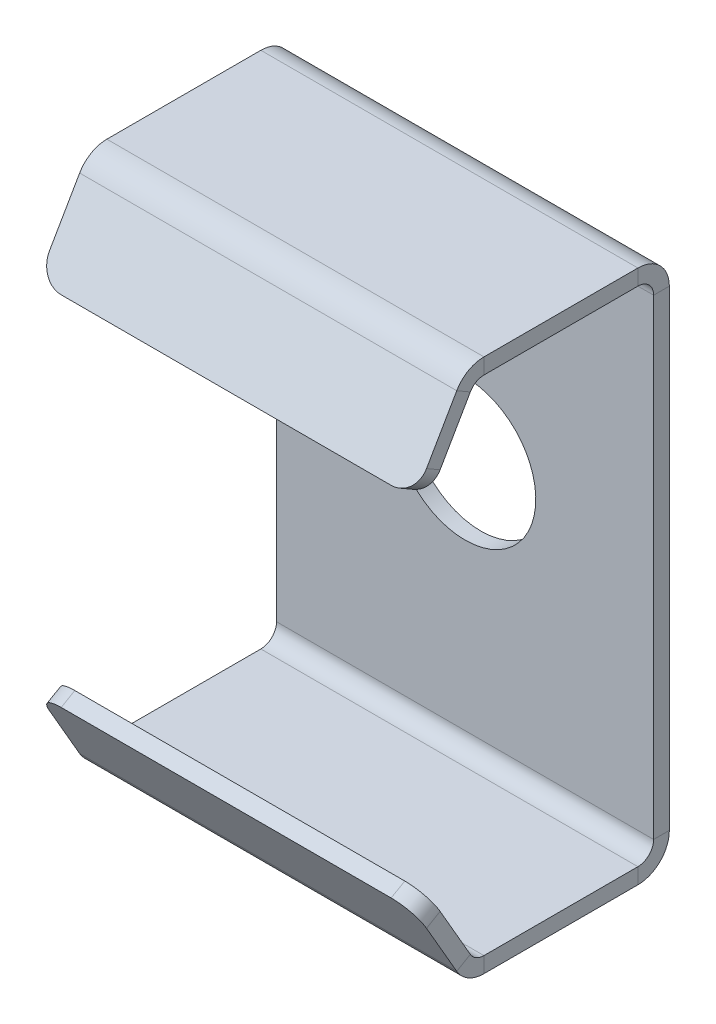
ISO-10303-21;
HEADER;
FILE_DESCRIPTION(('STEP AP214'),'2;1');
FILE_NAME('part.step','',(''),(''),'','','');
FILE_SCHEMA(('AUTOMOTIVE_DESIGN { 1 0 10303 214 1 1 1 1 }'));
ENDSEC;
DATA;
#1=APPLICATION_CONTEXT('core data for automotive mechanical design processes');
#2=APPLICATION_PROTOCOL_DEFINITION('international standard','automotive_design',2000,#1);
#3=PRODUCT_CONTEXT('',#1,'mechanical');
#4=PRODUCT('Part','Part','',(#3));
#5=PRODUCT_RELATED_PRODUCT_CATEGORY('part','',(#4));
#6=PRODUCT_DEFINITION_FORMATION('','',#4);
#7=PRODUCT_DEFINITION_CONTEXT('part definition',#1,'design');
#8=PRODUCT_DEFINITION('design','',#6,#7);
#9=PRODUCT_DEFINITION_SHAPE('','',#8);
#10=(LENGTH_UNIT() NAMED_UNIT(*) SI_UNIT(.MILLI.,.METRE.));
#11=(NAMED_UNIT(*) PLANE_ANGLE_UNIT() SI_UNIT($,.RADIAN.));
#12=(NAMED_UNIT(*) SI_UNIT($,.STERADIAN.) SOLID_ANGLE_UNIT());
#13=UNCERTAINTY_MEASURE_WITH_UNIT(LENGTH_MEASURE(1.E-05),#10,'distance_accuracy_value','');
#14=(GEOMETRIC_REPRESENTATION_CONTEXT(3) GLOBAL_UNCERTAINTY_ASSIGNED_CONTEXT((#13)) GLOBAL_UNIT_ASSIGNED_CONTEXT((#10,
#11,#12)) REPRESENTATION_CONTEXT('',''));
#15=CARTESIAN_POINT('',(0.,0.,0.));
#16=DIRECTION('',(0.,0.,1.));
#17=DIRECTION('',(1.,0.,0.));
#18=AXIS2_PLACEMENT_3D('',#15,#16,#17);
#19=CARTESIAN_POINT('',(10.5,-12.1698729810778,14.5886751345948));
#20=DIRECTION('',(0.,-0.5,0.866025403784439));
#21=DIRECTION('',(0.707106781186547,0.612372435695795,0.353553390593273));
#22=AXIS2_PLACEMENT_3D('',#19,#20,#21);
#23=CYLINDRICAL_SURFACE('',#22,1.5);
#24=CARTESIAN_POINT('',(10.5,-12.6698729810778,15.4547005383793));
#25=DIRECTION('',(0.,0.5,-0.866025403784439));
#26=DIRECTION('',(0.707106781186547,0.612372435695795,0.353553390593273));
#27=AXIS2_PLACEMENT_3D('',#24,#25,#26);
#28=CIRCLE('',#27,1.5);
#29=CARTESIAN_POINT('',(10.5,-11.3708348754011,16.2047005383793));
#30=VERTEX_POINT('',#29);
#31=CARTESIAN_POINT('',(12.,-12.6698729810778,15.4547005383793));
#32=VERTEX_POINT('',#31);
#33=EDGE_CURVE('E9',#30,#32,#28,.T.);
#34=ORIENTED_EDGE('',*,*,#33,.T.);
#35=DIRECTION('',(0.,0.5,-0.866025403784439));
#36=VECTOR('',#35,1.);
#37=CARTESIAN_POINT('',(12.,-12.1698729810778,14.5886751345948));
#38=LINE('',#37,#36);
#39=CARTESIAN_POINT('',(12.,-12.1698729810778,14.5886751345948));
#40=VERTEX_POINT('',#39);
#41=EDGE_CURVE('E25',#32,#40,#38,.T.);
#42=ORIENTED_EDGE('',*,*,#41,.T.);
#43=CARTESIAN_POINT('',(10.5,-12.1698729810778,14.5886751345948));
#44=DIRECTION('',(0.,-0.5,0.866025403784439));
#45=DIRECTION('',(0.707106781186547,0.612372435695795,0.353553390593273));
#46=AXIS2_PLACEMENT_3D('',#43,#44,#45);
#47=CIRCLE('',#46,1.5);
#48=CARTESIAN_POINT('',(10.5,-10.8708348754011,15.3386751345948));
#49=VERTEX_POINT('',#48);
#50=EDGE_CURVE('E438',#40,#49,#47,.T.);
#51=ORIENTED_EDGE('',*,*,#50,.T.);
#52=DIRECTION('',(0.,-0.5,0.866025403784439));
#53=VECTOR('',#52,1.);
#54=CARTESIAN_POINT('',(10.5,-10.8708348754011,15.3386751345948));
#55=LINE('',#54,#53);
#56=EDGE_CURVE('E433',#49,#30,#55,.T.);
#57=ORIENTED_EDGE('',*,*,#56,.T.);
#58=EDGE_LOOP('',(#34,#42,#51,#57));
#59=FACE_BOUND('',#58,.T.);
#60=ADVANCED_FACE('F14',(#59),#23,.T.);
#61=CARTESIAN_POINT('',(-12.,-10.8708348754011,15.3386751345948));
#62=DIRECTION('',(0.,0.866025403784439,0.5));
#63=DIRECTION('',(1.,0.,0.));
#64=AXIS2_PLACEMENT_3D('',#61,#62,#63);
#65=PLANE('',#64);
#66=ORIENTED_EDGE('',*,*,#56,.F.);
#67=DIRECTION('',(1.,0.,0.));
#68=VECTOR('',#67,1.);
#69=CARTESIAN_POINT('',(-12.,-10.8708348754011,15.3386751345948));
#70=LINE('',#69,#68);
#71=CARTESIAN_POINT('',(-10.5,-10.8708348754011,15.3386751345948));
#72=VERTEX_POINT('',#71);
#73=EDGE_CURVE('E468',#72,#49,#70,.T.);
#74=ORIENTED_EDGE('',*,*,#73,.F.);
#75=DIRECTION('',(0.,0.5,-0.866025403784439));
#76=VECTOR('',#75,1.);
#77=CARTESIAN_POINT('',(-10.5,-10.8708348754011,15.3386751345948));
#78=LINE('',#77,#76);
#79=CARTESIAN_POINT('',(-10.5,-11.3708348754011,16.2047005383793));
#80=VERTEX_POINT('',#79);
#81=EDGE_CURVE('E311',#80,#72,#78,.T.);
#82=ORIENTED_EDGE('',*,*,#81,.F.);
#83=DIRECTION('',(1.,0.,0.));
#84=VECTOR('',#83,1.);
#85=CARTESIAN_POINT('',(-12.,-11.3708348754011,16.2047005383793));
#86=LINE('',#85,#84);
#87=EDGE_CURVE('E429',#80,#30,#86,.T.);
#88=ORIENTED_EDGE('',*,*,#87,.T.);
#89=EDGE_LOOP('',(#66,#74,#82,#88));
#90=FACE_BOUND('',#89,.T.);
#91=ADVANCED_FACE('F657',(#90),#65,.T.);
#92=CARTESIAN_POINT('',(0.,-13.8383852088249,13.6253591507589));
#93=DIRECTION('',(0.,-0.5,0.866025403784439));
#94=DIRECTION('',(-1.,0.,0.));
#95=AXIS2_PLACEMENT_3D('',#92,#93,#94);
#96=PLANE('',#95);
#97=ORIENTED_EDGE('',*,*,#50,.F.);
#98=DIRECTION('',(0.,-0.866025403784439,-0.5));
#99=VECTOR('',#98,1.);
#100=CARTESIAN_POINT('',(12.,-19.4178066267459,10.4040786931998));
#101=LINE('',#100,#99);
#102=CARTESIAN_POINT('',(12.,-15.5,12.6660254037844));
#103=VERTEX_POINT('',#102);
#104=EDGE_CURVE('E434',#40,#103,#101,.T.);
#105=ORIENTED_EDGE('',*,*,#104,.T.);
#106=DIRECTION('',(-1.,0.,0.));
#107=VECTOR('',#106,1.);
#108=CARTESIAN_POINT('',(0.,-15.5,12.6660254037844));
#109=LINE('',#108,#107);
#110=CARTESIAN_POINT('',(-12.,-15.5,12.6660254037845));
#111=VERTEX_POINT('',#110);
#112=EDGE_CURVE('E472',#103,#111,#109,.T.);
#113=ORIENTED_EDGE('',*,*,#112,.T.);
#114=DIRECTION('',(0.,-0.866025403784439,-0.5));
#115=VECTOR('',#114,1.);
#116=CARTESIAN_POINT('',(-12.,-19.4178066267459,10.4040786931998));
#117=LINE('',#116,#115);
#118=CARTESIAN_POINT('',(-12.,-12.1698729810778,14.5886751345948));
#119=VERTEX_POINT('',#118);
#120=EDGE_CURVE('E328',#119,#111,#117,.T.);
#121=ORIENTED_EDGE('',*,*,#120,.F.);
#122=CARTESIAN_POINT('',(-10.5,-12.1698729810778,14.5886751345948));
#123=DIRECTION('',(0.,-0.5,0.866025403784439));
#124=DIRECTION('',(-0.707106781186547,0.612372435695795,0.353553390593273));
#125=AXIS2_PLACEMENT_3D('',#122,#123,#124);
#126=CIRCLE('',#125,1.5);
#127=EDGE_CURVE('E316',#72,#119,#126,.T.);
#128=ORIENTED_EDGE('',*,*,#127,.F.);
#129=ORIENTED_EDGE('',*,*,#73,.T.);
#130=EDGE_LOOP('',(#97,#105,#113,#121,#128,#129));
#131=FACE_BOUND('',#130,.T.);
#132=ADVANCED_FACE('F663',(#131),#96,.F.);
#133=CARTESIAN_POINT('',(-10.5,-12.1698729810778,14.5886751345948));
#134=DIRECTION('',(0.,-0.5,0.866025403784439));
#135=DIRECTION('',(-0.707106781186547,0.612372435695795,0.353553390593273));
#136=AXIS2_PLACEMENT_3D('',#133,#134,#135);
#137=CYLINDRICAL_SURFACE('',#136,1.5);
#138=CARTESIAN_POINT('',(-10.5,-12.6698729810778,15.4547005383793));
#139=DIRECTION('',(0.,0.5,-0.866025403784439));
#140=DIRECTION('',(-0.707106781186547,0.612372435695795,0.353553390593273));
#141=AXIS2_PLACEMENT_3D('',#138,#139,#140);
#142=CIRCLE('',#141,1.5);
#143=CARTESIAN_POINT('',(-12.,-12.6698729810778,15.4547005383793));
#144=VERTEX_POINT('',#143);
#145=EDGE_CURVE('E315',#144,#80,#142,.T.);
#146=ORIENTED_EDGE('',*,*,#145,.T.);
#147=ORIENTED_EDGE('',*,*,#81,.T.);
#148=ORIENTED_EDGE('',*,*,#127,.T.);
#149=DIRECTION('',(0.,-0.5,0.866025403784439));
#150=VECTOR('',#149,1.);
#151=CARTESIAN_POINT('',(-12.,-12.1698729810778,14.5886751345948));
#152=LINE('',#151,#150);
#153=EDGE_CURVE('E332',#119,#144,#152,.T.);
#154=ORIENTED_EDGE('',*,*,#153,.T.);
#155=EDGE_LOOP('',(#146,#147,#148,#154));
#156=FACE_BOUND('',#155,.T.);
#157=ADVANCED_FACE('F668',(#156),#137,.T.);
#158=CARTESIAN_POINT('',(-12.,-15.5,12.6660254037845));
#159=DIRECTION('',(-1.,0.,0.));
#160=DIRECTION('',(0.,1.,0.));
#161=AXIS2_PLACEMENT_3D('',#158,#159,#160);
#162=PLANE('',#161);
#163=ORIENTED_EDGE('',*,*,#153,.F.);
#164=ORIENTED_EDGE('',*,*,#120,.T.);
#165=DIRECTION('',(0.,-0.5,0.866025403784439));
#166=VECTOR('',#165,1.);
#167=CARTESIAN_POINT('',(-12.,-15.61,12.856550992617));
#168=LINE('',#167,#166);
#169=CARTESIAN_POINT('',(-12.,-16.,13.5320508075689));
#170=VERTEX_POINT('',#169);
#171=EDGE_CURVE('E333',#111,#170,#168,.T.);
#172=ORIENTED_EDGE('',*,*,#171,.T.);
#173=DIRECTION('',(0.,0.866025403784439,0.5));
#174=VECTOR('',#173,1.);
#175=CARTESIAN_POINT('',(-12.,-16.,13.5320508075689));
#176=LINE('',#175,#174);
#177=EDGE_CURVE('E368',#170,#144,#176,.T.);
#178=ORIENTED_EDGE('',*,*,#177,.T.);
#179=EDGE_LOOP('',(#163,#164,#172,#178));
#180=FACE_BOUND('',#179,.T.);
#181=ADVANCED_FACE('F680',(#180),#162,.T.);
#182=CARTESIAN_POINT('',(10.5,12.1698729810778,14.5886751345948));
#183=DIRECTION('',(0.,0.5,0.866025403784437));
#184=DIRECTION('',(0.707106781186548,-0.612372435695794,0.353553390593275));
#185=AXIS2_PLACEMENT_3D('',#182,#183,#184);
#186=CYLINDRICAL_SURFACE('',#185,1.5);
#187=CARTESIAN_POINT('',(10.5,12.6698729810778,15.4547005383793));
#188=DIRECTION('',(0.,-0.5,-0.866025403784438));
#189=DIRECTION('',(0.707106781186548,-0.612372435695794,0.353553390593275));
#190=AXIS2_PLACEMENT_3D('',#187,#188,#189);
#191=CIRCLE('',#190,1.5);
#192=CARTESIAN_POINT('',(12.,12.6698729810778,15.4547005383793));
#193=VERTEX_POINT('',#192);
#194=CARTESIAN_POINT('',(10.5,11.3708348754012,16.2047005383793));
#195=VERTEX_POINT('',#194);
#196=EDGE_CURVE('E357',#193,#195,#191,.T.);
#197=ORIENTED_EDGE('',*,*,#196,.T.);
#198=DIRECTION('',(0.,-0.5,-0.866025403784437));
#199=VECTOR('',#198,1.);
#200=CARTESIAN_POINT('',(10.5,10.8708348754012,15.3386751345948));
#201=LINE('',#200,#199);
#202=CARTESIAN_POINT('',(10.5,10.8708348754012,15.3386751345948));
#203=VERTEX_POINT('',#202);
#204=EDGE_CURVE('E353',#195,#203,#201,.T.);
#205=ORIENTED_EDGE('',*,*,#204,.T.);
#206=CARTESIAN_POINT('',(10.5,12.1698729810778,14.5886751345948));
#207=DIRECTION('',(0.,0.5,0.866025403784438));
#208=DIRECTION('',(0.707106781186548,-0.612372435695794,0.353553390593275));
#209=AXIS2_PLACEMENT_3D('',#206,#207,#208);
#210=CIRCLE('',#209,1.5);
#211=CARTESIAN_POINT('',(12.,12.1698729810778,14.5886751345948));
#212=VERTEX_POINT('',#211);
#213=EDGE_CURVE('E358',#203,#212,#210,.T.);
#214=ORIENTED_EDGE('',*,*,#213,.T.);
#215=DIRECTION('',(0.,0.5,0.866025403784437));
#216=VECTOR('',#215,1.);
#217=CARTESIAN_POINT('',(12.,12.1698729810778,14.5886751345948));
#218=LINE('',#217,#216);
#219=EDGE_CURVE('E387',#212,#193,#218,.T.);
#220=ORIENTED_EDGE('',*,*,#219,.T.);
#221=EDGE_LOOP('',(#197,#205,#214,#220));
#222=FACE_BOUND('',#221,.T.);
#223=ADVANCED_FACE('F629',(#222),#186,.T.);
#224=CARTESIAN_POINT('',(12.,15.5,12.6660254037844));
#225=DIRECTION('',(1.,0.,0.));
#226=DIRECTION('',(0.,-1.,0.));
#227=AXIS2_PLACEMENT_3D('',#224,#225,#226);
#228=PLANE('',#227);
#229=ORIENTED_EDGE('',*,*,#219,.F.);
#230=DIRECTION('',(0.,0.866025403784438,-0.5));
#231=VECTOR('',#230,1.);
#232=CARTESIAN_POINT('',(12.,19.4178066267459,10.4040786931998));
#233=LINE('',#232,#231);
#234=CARTESIAN_POINT('',(12.,15.5,12.6660254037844));
#235=VERTEX_POINT('',#234);
#236=EDGE_CURVE('E327',#212,#235,#233,.T.);
#237=ORIENTED_EDGE('',*,*,#236,.T.);
#238=DIRECTION('',(0.,0.5,0.866025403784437));
#239=VECTOR('',#238,1.);
#240=CARTESIAN_POINT('',(12.,15.61,12.856550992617));
#241=LINE('',#240,#239);
#242=CARTESIAN_POINT('',(12.,16.,13.5320508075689));
#243=VERTEX_POINT('',#242);
#244=EDGE_CURVE('E323',#235,#243,#241,.T.);
#245=ORIENTED_EDGE('',*,*,#244,.T.);
#246=DIRECTION('',(0.,-0.866025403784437,0.5));
#247=VECTOR('',#246,1.);
#248=CARTESIAN_POINT('',(12.,16.,13.5320508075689));
#249=LINE('',#248,#247);
#250=EDGE_CURVE('E321',#243,#193,#249,.T.);
#251=ORIENTED_EDGE('',*,*,#250,.T.);
#252=EDGE_LOOP('',(#229,#237,#245,#251));
#253=FACE_BOUND('',#252,.T.);
#254=ADVANCED_FACE('F625',(#253),#228,.T.);
#255=CARTESIAN_POINT('',(0.,13.8383852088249,13.6253591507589));
#256=DIRECTION('',(0.,-0.5,-0.866025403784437));
#257=DIRECTION('',(-1.,0.,0.));
#258=AXIS2_PLACEMENT_3D('',#255,#256,#257);
#259=PLANE('',#258);
#260=ORIENTED_EDGE('',*,*,#213,.F.);
#261=DIRECTION('',(-1.,0.,0.));
#262=VECTOR('',#261,1.);
#263=CARTESIAN_POINT('',(12.,10.8708348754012,15.3386751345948));
#264=LINE('',#263,#262);
#265=CARTESIAN_POINT('',(-10.5,10.8708348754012,15.3386751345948));
#266=VERTEX_POINT('',#265);
#267=EDGE_CURVE('E317',#203,#266,#264,.T.);
#268=ORIENTED_EDGE('',*,*,#267,.T.);
#269=CARTESIAN_POINT('',(-10.5,12.1698729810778,14.5886751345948));
#270=DIRECTION('',(0.,0.5,0.866025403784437));
#271=DIRECTION('',(-0.707106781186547,-0.612372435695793,0.353553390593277));
#272=AXIS2_PLACEMENT_3D('',#269,#270,#271);
#273=CIRCLE('',#272,1.5);
#274=CARTESIAN_POINT('',(-12.,12.1698729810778,14.5886751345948));
#275=VERTEX_POINT('',#274);
#276=EDGE_CURVE('E450',#275,#266,#273,.T.);
#277=ORIENTED_EDGE('',*,*,#276,.F.);
#278=DIRECTION('',(0.,0.866025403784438,-0.5));
#279=VECTOR('',#278,1.);
#280=CARTESIAN_POINT('',(-12.,19.4178066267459,10.4040786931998));
#281=LINE('',#280,#279);
#282=CARTESIAN_POINT('',(-12.,15.5,12.6660254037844));
#283=VERTEX_POINT('',#282);
#284=EDGE_CURVE('E322',#275,#283,#281,.T.);
#285=ORIENTED_EDGE('',*,*,#284,.T.);
#286=DIRECTION('',(1.,0.,0.));
#287=VECTOR('',#286,1.);
#288=CARTESIAN_POINT('',(0.,15.5,12.6660254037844));
#289=LINE('',#288,#287);
#290=EDGE_CURVE('E364',#283,#235,#289,.T.);
#291=ORIENTED_EDGE('',*,*,#290,.T.);
#292=ORIENTED_EDGE('',*,*,#236,.F.);
#293=EDGE_LOOP('',(#260,#268,#277,#285,#291,#292));
#294=FACE_BOUND('',#293,.T.);
#295=ADVANCED_FACE('F573',(#294),#259,.T.);
#296=CARTESIAN_POINT('',(-10.5,12.1698729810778,14.5886751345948));
#297=DIRECTION('',(0.,0.5,0.866025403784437));
#298=DIRECTION('',(-0.707106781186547,-0.612372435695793,0.353553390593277));
#299=AXIS2_PLACEMENT_3D('',#296,#297,#298);
#300=CYLINDRICAL_SURFACE('',#299,1.5);
#301=CARTESIAN_POINT('',(-10.5,12.6698729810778,15.4547005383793));
#302=DIRECTION('',(0.,-0.5,-0.866025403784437));
#303=DIRECTION('',(-0.707106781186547,-0.612372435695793,0.353553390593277));
#304=AXIS2_PLACEMENT_3D('',#301,#302,#303);
#305=CIRCLE('',#304,1.5);
#306=CARTESIAN_POINT('',(-10.5,11.3708348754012,16.2047005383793));
#307=VERTEX_POINT('',#306);
#308=CARTESIAN_POINT('',(-12.,12.6698729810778,15.4547005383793));
#309=VERTEX_POINT('',#308);
#310=EDGE_CURVE('E367',#307,#309,#305,.T.);
#311=ORIENTED_EDGE('',*,*,#310,.T.);
#312=DIRECTION('',(0.,-0.5,-0.866025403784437));
#313=VECTOR('',#312,1.);
#314=CARTESIAN_POINT('',(-12.,12.1698729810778,14.5886751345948));
#315=LINE('',#314,#313);
#316=EDGE_CURVE('E453',#309,#275,#315,.T.);
#317=ORIENTED_EDGE('',*,*,#316,.T.);
#318=ORIENTED_EDGE('',*,*,#276,.T.);
#319=DIRECTION('',(0.,0.5,0.866025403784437));
#320=VECTOR('',#319,1.);
#321=CARTESIAN_POINT('',(-10.5,10.8708348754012,15.3386751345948));
#322=LINE('',#321,#320);
#323=EDGE_CURVE('E280',#266,#307,#322,.T.);
#324=ORIENTED_EDGE('',*,*,#323,.T.);
#325=EDGE_LOOP('',(#311,#317,#318,#324));
#326=FACE_BOUND('',#325,.T.);
#327=ADVANCED_FACE('F636',(#326),#300,.T.);
#328=CARTESIAN_POINT('',(-12.,15.5,12.6660254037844));
#329=DIRECTION('',(-1.,0.,0.));
#330=DIRECTION('',(0.,0.,-1.));
#331=AXIS2_PLACEMENT_3D('',#328,#329,#330);
#332=PLANE('',#331);
#333=ORIENTED_EDGE('',*,*,#316,.F.);
#334=DIRECTION('',(0.,0.866025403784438,-0.5));
#335=VECTOR('',#334,1.);
#336=CARTESIAN_POINT('',(-12.,19.9178066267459,11.2701040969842));
#337=LINE('',#336,#335);
#338=CARTESIAN_POINT('',(-12.,16.,13.5320508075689));
#339=VERTEX_POINT('',#338);
#340=EDGE_CURVE('E276',#309,#339,#337,.T.);
#341=ORIENTED_EDGE('',*,*,#340,.T.);
#342=DIRECTION('',(0.,-0.5,-0.866025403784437));
#343=VECTOR('',#342,1.);
#344=CARTESIAN_POINT('',(-12.,15.61,12.856550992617));
#345=LINE('',#344,#343);
#346=EDGE_CURVE('E281',#339,#283,#345,.T.);
#347=ORIENTED_EDGE('',*,*,#346,.T.);
#348=ORIENTED_EDGE('',*,*,#284,.F.);
#349=EDGE_LOOP('',(#333,#341,#347,#348));
#350=FACE_BOUND('',#349,.T.);
#351=ADVANCED_FACE('F560',(#350),#332,.T.);
#352=CARTESIAN_POINT('',(0.,-15.,11.8));
#353=DIRECTION('',(-1.,0.,0.));
#354=DIRECTION('',(0.,-1.,0.));
#355=AXIS2_PLACEMENT_3D('',#352,#353,#354);
#356=CYLINDRICAL_SURFACE('',#355,2.);
#357=DIRECTION('',(1.,0.,0.));
#358=VECTOR('',#357,1.);
#359=CARTESIAN_POINT('',(0.,-16.,13.5320508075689));
#360=LINE('',#359,#358);
#361=CARTESIAN_POINT('',(12.,-16.,13.5320508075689));
#362=VERTEX_POINT('',#361);
#363=EDGE_CURVE('E334',#170,#362,#360,.T.);
#364=ORIENTED_EDGE('',*,*,#363,.F.);
#365=CARTESIAN_POINT('',(-12.,-15.,11.8));
#366=DIRECTION('',(-1.,0.,0.));
#367=DIRECTION('',(0.,-1.,0.));
#368=AXIS2_PLACEMENT_3D('',#365,#366,#367);
#369=CIRCLE('',#368,2.);
#370=CARTESIAN_POINT('',(-12.,-17.,11.8));
#371=VERTEX_POINT('',#370);
#372=EDGE_CURVE('E394',#371,#170,#369,.T.);
#373=ORIENTED_EDGE('',*,*,#372,.F.);
#374=DIRECTION('',(1.,0.,0.));
#375=VECTOR('',#374,1.);
#376=CARTESIAN_POINT('',(-12.,-17.,11.8));
#377=LINE('',#376,#375);
#378=CARTESIAN_POINT('',(12.,-17.,11.8));
#379=VERTEX_POINT('',#378);
#380=EDGE_CURVE('E491',#371,#379,#377,.T.);
#381=ORIENTED_EDGE('',*,*,#380,.T.);
#382=CARTESIAN_POINT('',(12.,-15.,11.8));
#383=DIRECTION('',(1.,0.,0.));
#384=DIRECTION('',(0.,-0.5,0.866025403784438));
#385=AXIS2_PLACEMENT_3D('',#382,#383,#384);
#386=CIRCLE('',#385,2.);
#387=EDGE_CURVE('E337',#362,#379,#386,.T.);
#388=ORIENTED_EDGE('',*,*,#387,.F.);
#389=EDGE_LOOP('',(#364,#373,#381,#388));
#390=FACE_BOUND('',#389,.T.);
#391=ADVANCED_FACE('F689',(#390),#356,.T.);
#392=CARTESIAN_POINT('',(12.,-15.5,12.6660254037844));
#393=DIRECTION('',(1.,0.,0.));
#394=DIRECTION('',(0.,-1.,0.));
#395=AXIS2_PLACEMENT_3D('',#392,#393,#394);
#396=PLANE('',#395);
#397=ORIENTED_EDGE('',*,*,#41,.F.);
#398=DIRECTION('',(0.,-0.866025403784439,-0.5));
#399=VECTOR('',#398,1.);
#400=CARTESIAN_POINT('',(12.,-19.9178066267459,11.2701040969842));
#401=LINE('',#400,#399);
#402=EDGE_CURVE('E495',#32,#362,#401,.T.);
#403=ORIENTED_EDGE('',*,*,#402,.T.);
#404=DIRECTION('',(0.,0.5,-0.866025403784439));
#405=VECTOR('',#404,1.);
#406=CARTESIAN_POINT('',(12.,-15.61,12.856550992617));
#407=LINE('',#406,#405);
#408=EDGE_CURVE('E343',#362,#103,#407,.T.);
#409=ORIENTED_EDGE('',*,*,#408,.T.);
#410=ORIENTED_EDGE('',*,*,#104,.F.);
#411=EDGE_LOOP('',(#397,#403,#409,#410));
#412=FACE_BOUND('',#411,.T.);
#413=ADVANCED_FACE('F723',(#412),#396,.T.);
#414=CARTESIAN_POINT('',(-12.,-15.5,12.6660254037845));
#415=DIRECTION('',(-1.,0.,0.));
#416=DIRECTION('',(0.,1.,0.));
#417=AXIS2_PLACEMENT_3D('',#414,#415,#416);
#418=PLANE('',#417);
#419=ORIENTED_EDGE('',*,*,#171,.F.);
#420=CARTESIAN_POINT('',(-12.,-15.,11.8));
#421=DIRECTION('',(1.,0.,0.));
#422=DIRECTION('',(0.,-0.5,0.866025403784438));
#423=AXIS2_PLACEMENT_3D('',#420,#421,#422);
#424=CIRCLE('',#423,1.);
#425=CARTESIAN_POINT('',(-12.,-16.,11.8));
#426=VERTEX_POINT('',#425);
#427=EDGE_CURVE('E339',#111,#426,#424,.T.);
#428=ORIENTED_EDGE('',*,*,#427,.T.);
#429=DIRECTION('',(0.,-1.,0.));
#430=VECTOR('',#429,1.);
#431=CARTESIAN_POINT('',(-12.,-16.,11.8));
#432=LINE('',#431,#430);
#433=EDGE_CURVE('E344',#426,#371,#432,.T.);
#434=ORIENTED_EDGE('',*,*,#433,.T.);
#435=ORIENTED_EDGE('',*,*,#372,.T.);
#436=EDGE_LOOP('',(#419,#428,#434,#435));
#437=FACE_BOUND('',#436,.T.);
#438=ADVANCED_FACE('F720',(#437),#418,.T.);
#439=CARTESIAN_POINT('',(12.,-16.,13.5320508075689));
#440=DIRECTION('',(1.,0.,0.));
#441=DIRECTION('',(0.,-1.,0.));
#442=AXIS2_PLACEMENT_3D('',#439,#440,#441);
#443=PLANE('',#442);
#444=ORIENTED_EDGE('',*,*,#408,.F.);
#445=ORIENTED_EDGE('',*,*,#387,.T.);
#446=DIRECTION('',(0.,-1.,0.));
#447=VECTOR('',#446,1.);
#448=CARTESIAN_POINT('',(12.,-16.,11.8));
#449=LINE('',#448,#447);
#450=CARTESIAN_POINT('',(12.,-16.,11.8));
#451=VERTEX_POINT('',#450);
#452=EDGE_CURVE('E247',#451,#379,#449,.T.);
#453=ORIENTED_EDGE('',*,*,#452,.F.);
#454=CARTESIAN_POINT('',(12.,-15.,11.8));
#455=DIRECTION('',(1.,0.,0.));
#456=DIRECTION('',(0.,-0.5,0.866025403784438));
#457=AXIS2_PLACEMENT_3D('',#454,#455,#456);
#458=CIRCLE('',#457,1.);
#459=EDGE_CURVE('E338',#103,#451,#458,.T.);
#460=ORIENTED_EDGE('',*,*,#459,.F.);
#461=EDGE_LOOP('',(#444,#445,#453,#460));
#462=FACE_BOUND('',#461,.T.);
#463=ADVANCED_FACE('F676',(#462),#443,.T.);
#464=CARTESIAN_POINT('',(0.,-14.3383852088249,14.4913845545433));
#465=DIRECTION('',(0.,-0.5,0.866025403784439));
#466=DIRECTION('',(-1.,0.,0.));
#467=AXIS2_PLACEMENT_3D('',#464,#465,#466);
#468=PLANE('',#467);
#469=ORIENTED_EDGE('',*,*,#33,.F.);
#470=ORIENTED_EDGE('',*,*,#87,.F.);
#471=ORIENTED_EDGE('',*,*,#145,.F.);
#472=ORIENTED_EDGE('',*,*,#177,.F.);
#473=ORIENTED_EDGE('',*,*,#363,.T.);
#474=ORIENTED_EDGE('',*,*,#402,.F.);
#475=EDGE_LOOP('',(#469,#470,#471,#472,#473,#474));
#476=FACE_BOUND('',#475,.T.);
#477=ADVANCED_FACE('F651',(#476),#468,.T.);
#478=CARTESIAN_POINT('',(0.,-15.,11.8));
#479=DIRECTION('',(-1.,0.,0.));
#480=DIRECTION('',(0.,-1.,0.));
#481=AXIS2_PLACEMENT_3D('',#478,#479,#480);
#482=CYLINDRICAL_SURFACE('',#481,1.);
#483=ORIENTED_EDGE('',*,*,#112,.F.);
#484=ORIENTED_EDGE('',*,*,#459,.T.);
#485=DIRECTION('',(1.,0.,0.));
#486=VECTOR('',#485,1.);
#487=CARTESIAN_POINT('',(-12.,-16.,11.8));
#488=LINE('',#487,#486);
#489=EDGE_CURVE('E262',#426,#451,#488,.T.);
#490=ORIENTED_EDGE('',*,*,#489,.F.);
#491=ORIENTED_EDGE('',*,*,#427,.F.);
#492=EDGE_LOOP('',(#483,#484,#490,#491));
#493=FACE_BOUND('',#492,.T.);
#494=ADVANCED_FACE('F643',(#493),#482,.F.);
#495=CARTESIAN_POINT('',(0.,15.,11.8));
#496=DIRECTION('',(1.,0.,0.));
#497=DIRECTION('',(0.,1.,0.));
#498=AXIS2_PLACEMENT_3D('',#495,#496,#497);
#499=CYLINDRICAL_SURFACE('',#498,2.);
#500=DIRECTION('',(-1.,0.,0.));
#501=VECTOR('',#500,1.);
#502=CARTESIAN_POINT('',(0.,16.,13.5320508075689));
#503=LINE('',#502,#501);
#504=EDGE_CURVE('E282',#243,#339,#503,.T.);
#505=ORIENTED_EDGE('',*,*,#504,.F.);
#506=CARTESIAN_POINT('',(12.,15.,11.8));
#507=DIRECTION('',(1.,0.,0.));
#508=DIRECTION('',(0.,1.,0.));
#509=AXIS2_PLACEMENT_3D('',#506,#507,#508);
#510=CIRCLE('',#509,2.);
#511=CARTESIAN_POINT('',(12.,17.,11.8));
#512=VERTEX_POINT('',#511);
#513=EDGE_CURVE('E473',#512,#243,#510,.T.);
#514=ORIENTED_EDGE('',*,*,#513,.F.);
#515=DIRECTION('',(-1.,0.,0.));
#516=VECTOR('',#515,1.);
#517=CARTESIAN_POINT('',(12.,17.,11.8));
#518=LINE('',#517,#516);
#519=CARTESIAN_POINT('',(-12.,17.,11.8));
#520=VERTEX_POINT('',#519);
#521=EDGE_CURVE('E301',#512,#520,#518,.T.);
#522=ORIENTED_EDGE('',*,*,#521,.T.);
#523=CARTESIAN_POINT('',(-12.,15.,11.8));
#524=DIRECTION('',(-1.,0.,0.));
#525=DIRECTION('',(0.,0.5,0.866025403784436));
#526=AXIS2_PLACEMENT_3D('',#523,#524,#525);
#527=CIRCLE('',#526,2.);
#528=EDGE_CURVE('E459',#339,#520,#527,.T.);
#529=ORIENTED_EDGE('',*,*,#528,.F.);
#530=EDGE_LOOP('',(#505,#514,#522,#529));
#531=FACE_BOUND('',#530,.T.);
#532=ADVANCED_FACE('F641',(#531),#499,.T.);
#533=CARTESIAN_POINT('',(12.,15.5,12.6660254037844));
#534=DIRECTION('',(1.,0.,0.));
#535=DIRECTION('',(0.,-1.,0.));
#536=AXIS2_PLACEMENT_3D('',#533,#534,#535);
#537=PLANE('',#536);
#538=ORIENTED_EDGE('',*,*,#244,.F.);
#539=CARTESIAN_POINT('',(12.,15.,11.8));
#540=DIRECTION('',(-1.,0.,0.));
#541=DIRECTION('',(0.,0.5,0.866025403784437));
#542=AXIS2_PLACEMENT_3D('',#539,#540,#541);
#543=CIRCLE('',#542,1.);
#544=CARTESIAN_POINT('',(12.,16.,11.8));
#545=VERTEX_POINT('',#544);
#546=EDGE_CURVE('E297',#235,#545,#543,.T.);
#547=ORIENTED_EDGE('',*,*,#546,.T.);
#548=DIRECTION('',(0.,1.,0.));
#549=VECTOR('',#548,1.);
#550=CARTESIAN_POINT('',(12.,16.,11.8));
#551=LINE('',#550,#549);
#552=EDGE_CURVE('E302',#545,#512,#551,.T.);
#553=ORIENTED_EDGE('',*,*,#552,.T.);
#554=ORIENTED_EDGE('',*,*,#513,.T.);
#555=EDGE_LOOP('',(#538,#547,#553,#554));
#556=FACE_BOUND('',#555,.T.);
#557=ADVANCED_FACE('F623',(#556),#537,.T.);
#558=CARTESIAN_POINT('',(-12.,16.,13.5320508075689));
#559=DIRECTION('',(-1.,0.,0.));
#560=DIRECTION('',(0.,0.,-1.));
#561=AXIS2_PLACEMENT_3D('',#558,#559,#560);
#562=PLANE('',#561);
#563=ORIENTED_EDGE('',*,*,#346,.F.);
#564=ORIENTED_EDGE('',*,*,#528,.T.);
#565=DIRECTION('',(0.,1.,0.));
#566=VECTOR('',#565,1.);
#567=CARTESIAN_POINT('',(-12.,16.,11.8));
#568=LINE('',#567,#566);
#569=CARTESIAN_POINT('',(-12.,16.,11.8));
#570=VERTEX_POINT('',#569);
#571=EDGE_CURVE('E395',#570,#520,#568,.T.);
#572=ORIENTED_EDGE('',*,*,#571,.F.);
#573=CARTESIAN_POINT('',(-12.,15.,11.8));
#574=DIRECTION('',(-1.,0.,0.));
#575=DIRECTION('',(0.,0.5,0.866025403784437));
#576=AXIS2_PLACEMENT_3D('',#573,#574,#575);
#577=CIRCLE('',#576,1.);
#578=EDGE_CURVE('E286',#283,#570,#577,.T.);
#579=ORIENTED_EDGE('',*,*,#578,.F.);
#580=EDGE_LOOP('',(#563,#564,#572,#579));
#581=FACE_BOUND('',#580,.T.);
#582=ADVANCED_FACE('F577',(#581),#562,.T.);
#583=CARTESIAN_POINT('',(12.,10.8708348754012,15.3386751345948));
#584=DIRECTION('',(0.,-0.866025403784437,0.5));
#585=DIRECTION('',(-1.,0.,0.));
#586=AXIS2_PLACEMENT_3D('',#583,#584,#585);
#587=PLANE('',#586);
#588=ORIENTED_EDGE('',*,*,#204,.F.);
#589=DIRECTION('',(-1.,0.,0.));
#590=VECTOR('',#589,1.);
#591=CARTESIAN_POINT('',(12.,11.3708348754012,16.2047005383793));
#592=LINE('',#591,#590);
#593=EDGE_CURVE('E285',#195,#307,#592,.T.);
#594=ORIENTED_EDGE('',*,*,#593,.T.);
#595=ORIENTED_EDGE('',*,*,#323,.F.);
#596=ORIENTED_EDGE('',*,*,#267,.F.);
#597=EDGE_LOOP('',(#588,#594,#595,#596));
#598=FACE_BOUND('',#597,.T.);
#599=ADVANCED_FACE('F633',(#598),#587,.T.);
#600=CARTESIAN_POINT('',(0.,14.3383852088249,14.4913845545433));
#601=DIRECTION('',(0.,-0.5,-0.866025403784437));
#602=DIRECTION('',(-1.,0.,0.));
#603=AXIS2_PLACEMENT_3D('',#600,#601,#602);
#604=PLANE('',#603);
#605=ORIENTED_EDGE('',*,*,#196,.F.);
#606=ORIENTED_EDGE('',*,*,#250,.F.);
#607=ORIENTED_EDGE('',*,*,#504,.T.);
#608=ORIENTED_EDGE('',*,*,#340,.F.);
#609=ORIENTED_EDGE('',*,*,#310,.F.);
#610=ORIENTED_EDGE('',*,*,#593,.F.);
#611=EDGE_LOOP('',(#605,#606,#607,#608,#609,#610));
#612=FACE_BOUND('',#611,.T.);
#613=ADVANCED_FACE('F638',(#612),#604,.F.);
#614=CARTESIAN_POINT('',(0.,15.,11.8));
#615=DIRECTION('',(1.,0.,0.));
#616=DIRECTION('',(0.,1.,0.));
#617=AXIS2_PLACEMENT_3D('',#614,#615,#616);
#618=CYLINDRICAL_SURFACE('',#617,1.);
#619=ORIENTED_EDGE('',*,*,#290,.F.);
#620=ORIENTED_EDGE('',*,*,#578,.T.);
#621=DIRECTION('',(-1.,0.,0.));
#622=VECTOR('',#621,1.);
#623=CARTESIAN_POINT('',(12.,16.,11.8));
#624=LINE('',#623,#622);
#625=EDGE_CURVE('E290',#545,#570,#624,.T.);
#626=ORIENTED_EDGE('',*,*,#625,.F.);
#627=ORIENTED_EDGE('',*,*,#546,.F.);
#628=EDGE_LOOP('',(#619,#620,#626,#627));
#629=FACE_BOUND('',#628,.T.);
#630=ADVANCED_FACE('F568',(#629),#618,.F.);
#631=CARTESIAN_POINT('',(0.,-15.,2.));
#632=DIRECTION('',(-1.,0.,0.));
#633=DIRECTION('',(0.,0.,-1.));
#634=AXIS2_PLACEMENT_3D('',#631,#632,#633);
#635=CYLINDRICAL_SURFACE('',#634,2.);
#636=DIRECTION('',(1.,0.,0.));
#637=VECTOR('',#636,1.);
#638=CARTESIAN_POINT('',(0.,-17.,2.));
#639=LINE('',#638,#637);
#640=CARTESIAN_POINT('',(-12.,-17.,2.));
#641=VERTEX_POINT('',#640);
#642=CARTESIAN_POINT('',(12.,-17.,2.));
#643=VERTEX_POINT('',#642);
#644=EDGE_CURVE('E211',#641,#643,#639,.T.);
#645=ORIENTED_EDGE('',*,*,#644,.F.);
#646=CARTESIAN_POINT('',(-12.,-15.,2.));
#647=DIRECTION('',(-1.,0.,0.));
#648=DIRECTION('',(0.,0.,-1.));
#649=AXIS2_PLACEMENT_3D('',#646,#647,#648);
#650=CIRCLE('',#649,2.);
#651=CARTESIAN_POINT('',(-12.,-15.,0.));
#652=VERTEX_POINT('',#651);
#653=EDGE_CURVE('E236',#652,#641,#650,.T.);
#654=ORIENTED_EDGE('',*,*,#653,.F.);
#655=DIRECTION('',(1.,0.,0.));
#656=VECTOR('',#655,1.);
#657=CARTESIAN_POINT('',(-12.,-15.,0.));
#658=LINE('',#657,#656);
#659=CARTESIAN_POINT('',(12.,-15.,0.));
#660=VERTEX_POINT('',#659);
#661=EDGE_CURVE('E231',#652,#660,#658,.T.);
#662=ORIENTED_EDGE('',*,*,#661,.T.);
#663=CARTESIAN_POINT('',(12.,-15.,2.));
#664=DIRECTION('',(1.,0.,0.));
#665=DIRECTION('',(0.,-1.,0.));
#666=AXIS2_PLACEMENT_3D('',#663,#664,#665);
#667=CIRCLE('',#666,2.);
#668=EDGE_CURVE('E227',#643,#660,#667,.T.);
#669=ORIENTED_EDGE('',*,*,#668,.F.);
#670=EDGE_LOOP('',(#645,#654,#662,#669));
#671=FACE_BOUND('',#670,.T.);
#672=ADVANCED_FACE('F229',(#671),#635,.T.);
#673=CARTESIAN_POINT('',(12.,-16.,2.));
#674=DIRECTION('',(1.,0.,0.));
#675=DIRECTION('',(0.,-1.,0.));
#676=AXIS2_PLACEMENT_3D('',#673,#674,#675);
#677=PLANE('',#676);
#678=DIRECTION('',(0.,1.,0.));
#679=VECTOR('',#678,1.);
#680=CARTESIAN_POINT('',(12.,-16.22,2.));
#681=LINE('',#680,#679);
#682=CARTESIAN_POINT('',(12.,-16.,2.));
#683=VERTEX_POINT('',#682);
#684=EDGE_CURVE('E241',#643,#683,#681,.T.);
#685=ORIENTED_EDGE('',*,*,#684,.T.);
#686=DIRECTION('',(0.,0.,-1.));
#687=VECTOR('',#686,1.);
#688=CARTESIAN_POINT('',(12.,-16.,-2.52389342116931));
#689=LINE('',#688,#687);
#690=EDGE_CURVE('E296',#451,#683,#689,.T.);
#691=ORIENTED_EDGE('',*,*,#690,.F.);
#692=ORIENTED_EDGE('',*,*,#452,.T.);
#693=DIRECTION('',(0.,0.,-1.));
#694=VECTOR('',#693,1.);
#695=CARTESIAN_POINT('',(12.,-17.,-2.52389342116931));
#696=LINE('',#695,#694);
#697=EDGE_CURVE('E216',#379,#643,#696,.T.);
#698=ORIENTED_EDGE('',*,*,#697,.T.);
#699=EDGE_LOOP('',(#685,#691,#692,#698));
#700=FACE_BOUND('',#699,.T.);
#701=ADVANCED_FACE('F249',(#700),#677,.T.);
#702=CARTESIAN_POINT('',(0.,-16.,5.76902664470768));
#703=DIRECTION('',(0.,1.,0.));
#704=DIRECTION('',(1.,0.,0.));
#705=AXIS2_PLACEMENT_3D('',#702,#703,#704);
#706=PLANE('',#705);
#707=DIRECTION('',(-1.,0.,0.));
#708=VECTOR('',#707,1.);
#709=CARTESIAN_POINT('',(0.,-16.,2.));
#710=LINE('',#709,#708);
#711=CARTESIAN_POINT('',(-12.,-16.,2.));
#712=VERTEX_POINT('',#711);
#713=EDGE_CURVE('E253',#683,#712,#710,.T.);
#714=ORIENTED_EDGE('',*,*,#713,.T.);
#715=DIRECTION('',(0.,0.,-1.));
#716=VECTOR('',#715,1.);
#717=CARTESIAN_POINT('',(-12.,-16.,-2.5238934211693));
#718=LINE('',#717,#716);
#719=EDGE_CURVE('E222',#426,#712,#718,.T.);
#720=ORIENTED_EDGE('',*,*,#719,.F.);
#721=ORIENTED_EDGE('',*,*,#489,.T.);
#722=ORIENTED_EDGE('',*,*,#690,.T.);
#723=EDGE_LOOP('',(#714,#720,#721,#722));
#724=FACE_BOUND('',#723,.T.);
#725=ADVANCED_FACE('F716',(#724),#706,.T.);
#726=CARTESIAN_POINT('',(-12.,-16.,2.));
#727=DIRECTION('',(-1.,0.,0.));
#728=DIRECTION('',(0.,0.,-1.));
#729=AXIS2_PLACEMENT_3D('',#726,#727,#728);
#730=PLANE('',#729);
#731=DIRECTION('',(0.,-1.,0.));
#732=VECTOR('',#731,1.);
#733=CARTESIAN_POINT('',(-12.,-16.22,2.));
#734=LINE('',#733,#732);
#735=EDGE_CURVE('E437',#712,#641,#734,.T.);
#736=ORIENTED_EDGE('',*,*,#735,.F.);
#737=CARTESIAN_POINT('',(-12.,-15.,2.));
#738=DIRECTION('',(1.,0.,0.));
#739=DIRECTION('',(0.,-1.,0.));
#740=AXIS2_PLACEMENT_3D('',#737,#738,#739);
#741=CIRCLE('',#740,1.);
#742=CARTESIAN_POINT('',(-12.,-15.,1.));
#743=VERTEX_POINT('',#742);
#744=EDGE_CURVE('E292',#712,#743,#741,.T.);
#745=ORIENTED_EDGE('',*,*,#744,.T.);
#746=DIRECTION('',(0.,0.,1.));
#747=VECTOR('',#746,1.);
#748=CARTESIAN_POINT('',(-12.,-15.,0.));
#749=LINE('',#748,#747);
#750=EDGE_CURVE('E424',#652,#743,#749,.T.);
#751=ORIENTED_EDGE('',*,*,#750,.F.);
#752=ORIENTED_EDGE('',*,*,#653,.T.);
#753=EDGE_LOOP('',(#736,#745,#751,#752));
#754=FACE_BOUND('',#753,.T.);
#755=ADVANCED_FACE('F695',(#754),#730,.T.);
#756=CARTESIAN_POINT('',(12.,-17.,2.));
#757=DIRECTION('',(1.,0.,0.));
#758=DIRECTION('',(0.,-1.,0.));
#759=AXIS2_PLACEMENT_3D('',#756,#757,#758);
#760=PLANE('',#759);
#761=ORIENTED_EDGE('',*,*,#684,.F.);
#762=ORIENTED_EDGE('',*,*,#668,.T.);
#763=DIRECTION('',(0.,0.,1.));
#764=VECTOR('',#763,1.);
#765=CARTESIAN_POINT('',(12.,-15.,0.));
#766=LINE('',#765,#764);
#767=CARTESIAN_POINT('',(12.,-15.,1.));
#768=VERTEX_POINT('',#767);
#769=EDGE_CURVE('E237',#660,#768,#766,.T.);
#770=ORIENTED_EDGE('',*,*,#769,.T.);
#771=CARTESIAN_POINT('',(12.,-15.,2.));
#772=DIRECTION('',(1.,0.,0.));
#773=DIRECTION('',(0.,-1.,0.));
#774=AXIS2_PLACEMENT_3D('',#771,#772,#773);
#775=CIRCLE('',#774,1.);
#776=EDGE_CURVE('E223',#683,#768,#775,.T.);
#777=ORIENTED_EDGE('',*,*,#776,.F.);
#778=EDGE_LOOP('',(#761,#762,#770,#777));
#779=FACE_BOUND('',#778,.T.);
#780=ADVANCED_FACE('F242',(#779),#760,.T.);
#781=CARTESIAN_POINT('',(-12.,-16.,2.));
#782=DIRECTION('',(-1.,0.,0.));
#783=DIRECTION('',(0.,0.,-1.));
#784=AXIS2_PLACEMENT_3D('',#781,#782,#783);
#785=PLANE('',#784);
#786=ORIENTED_EDGE('',*,*,#735,.T.);
#787=DIRECTION('',(0.,0.,1.));
#788=VECTOR('',#787,1.);
#789=CARTESIAN_POINT('',(-12.,-17.,2.));
#790=LINE('',#789,#788);
#791=EDGE_CURVE('E18',#641,#371,#790,.T.);
#792=ORIENTED_EDGE('',*,*,#791,.T.);
#793=ORIENTED_EDGE('',*,*,#433,.F.);
#794=ORIENTED_EDGE('',*,*,#719,.T.);
#795=EDGE_LOOP('',(#786,#792,#793,#794));
#796=FACE_BOUND('',#795,.T.);
#797=ADVANCED_FACE('F693',(#796),#785,.T.);
#798=CARTESIAN_POINT('',(0.,-17.,5.76902664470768));
#799=DIRECTION('',(0.,1.,0.));
#800=DIRECTION('',(1.,0.,0.));
#801=AXIS2_PLACEMENT_3D('',#798,#799,#800);
#802=PLANE('',#801);
#803=ORIENTED_EDGE('',*,*,#644,.T.);
#804=ORIENTED_EDGE('',*,*,#697,.F.);
#805=ORIENTED_EDGE('',*,*,#380,.F.);
#806=ORIENTED_EDGE('',*,*,#791,.F.);
#807=EDGE_LOOP('',(#803,#804,#805,#806));
#808=FACE_BOUND('',#807,.T.);
#809=ADVANCED_FACE('F213',(#808),#802,.F.);
#810=CARTESIAN_POINT('',(0.,-15.,2.));
#811=DIRECTION('',(-1.,0.,0.));
#812=DIRECTION('',(0.,0.,-1.));
#813=AXIS2_PLACEMENT_3D('',#810,#811,#812);
#814=CYLINDRICAL_SURFACE('',#813,1.);
#815=ORIENTED_EDGE('',*,*,#713,.F.);
#816=ORIENTED_EDGE('',*,*,#776,.T.);
#817=DIRECTION('',(-1.,0.,0.));
#818=VECTOR('',#817,1.);
#819=CARTESIAN_POINT('',(-12.,-15.,1.));
#820=LINE('',#819,#818);
#821=EDGE_CURVE('E269',#768,#743,#820,.T.);
#822=ORIENTED_EDGE('',*,*,#821,.T.);
#823=ORIENTED_EDGE('',*,*,#744,.F.);
#824=EDGE_LOOP('',(#815,#816,#822,#823));
#825=FACE_BOUND('',#824,.T.);
#826=ADVANCED_FACE('F692',(#825),#814,.F.);
#827=CARTESIAN_POINT('',(0.,15.,2.));
#828=DIRECTION('',(1.,0.,0.));
#829=DIRECTION('',(0.,0.,-1.));
#830=AXIS2_PLACEMENT_3D('',#827,#828,#829);
#831=CYLINDRICAL_SURFACE('',#830,2.);
#832=DIRECTION('',(-1.,0.,0.));
#833=VECTOR('',#832,1.);
#834=CARTESIAN_POINT('',(0.,17.,2.));
#835=LINE('',#834,#833);
#836=CARTESIAN_POINT('',(12.,17.,2.));
#837=VERTEX_POINT('',#836);
#838=CARTESIAN_POINT('',(-12.,17.,2.));
#839=VERTEX_POINT('',#838);
#840=EDGE_CURVE('E305',#837,#839,#835,.T.);
#841=ORIENTED_EDGE('',*,*,#840,.F.);
#842=CARTESIAN_POINT('',(12.,15.,2.));
#843=DIRECTION('',(1.,0.,0.));
#844=DIRECTION('',(0.,0.,-1.));
#845=AXIS2_PLACEMENT_3D('',#842,#843,#844);
#846=CIRCLE('',#845,2.);
#847=CARTESIAN_POINT('',(12.,15.,0.));
#848=VERTEX_POINT('',#847);
#849=EDGE_CURVE('E348',#848,#837,#846,.T.);
#850=ORIENTED_EDGE('',*,*,#849,.F.);
#851=DIRECTION('',(-1.,0.,0.));
#852=VECTOR('',#851,1.);
#853=CARTESIAN_POINT('',(12.,15.,0.));
#854=LINE('',#853,#852);
#855=CARTESIAN_POINT('',(-12.,15.,0.));
#856=VERTEX_POINT('',#855);
#857=EDGE_CURVE('E403',#848,#856,#854,.T.);
#858=ORIENTED_EDGE('',*,*,#857,.T.);
#859=CARTESIAN_POINT('',(-12.,15.,2.));
#860=DIRECTION('',(-1.,0.,0.));
#861=DIRECTION('',(0.,1.,0.));
#862=AXIS2_PLACEMENT_3D('',#859,#860,#861);
#863=CIRCLE('',#862,2.);
#864=EDGE_CURVE('E352',#839,#856,#863,.T.);
#865=ORIENTED_EDGE('',*,*,#864,.F.);
#866=EDGE_LOOP('',(#841,#850,#858,#865));
#867=FACE_BOUND('',#866,.T.);
#868=ADVANCED_FACE('F613',(#867),#831,.T.);
#869=CARTESIAN_POINT('',(-12.,16.,2.));
#870=DIRECTION('',(-1.,0.,0.));
#871=DIRECTION('',(0.,0.,-1.));
#872=AXIS2_PLACEMENT_3D('',#869,#870,#871);
#873=PLANE('',#872);
#874=DIRECTION('',(0.,-1.,0.));
#875=VECTOR('',#874,1.);
#876=CARTESIAN_POINT('',(-12.,16.22,2.));
#877=LINE('',#876,#875);
#878=CARTESIAN_POINT('',(-12.,16.,2.));
#879=VERTEX_POINT('',#878);
#880=EDGE_CURVE('E398',#839,#879,#877,.T.);
#881=ORIENTED_EDGE('',*,*,#880,.T.);
#882=DIRECTION('',(0.,0.,-1.));
#883=VECTOR('',#882,1.);
#884=CARTESIAN_POINT('',(-12.,16.,-2.52389342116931));
#885=LINE('',#884,#883);
#886=EDGE_CURVE('E287',#570,#879,#885,.T.);
#887=ORIENTED_EDGE('',*,*,#886,.F.);
#888=ORIENTED_EDGE('',*,*,#571,.T.);
#889=DIRECTION('',(0.,0.,-1.));
#890=VECTOR('',#889,1.);
#891=CARTESIAN_POINT('',(-12.,17.,-2.52389342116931));
#892=LINE('',#891,#890);
#893=EDGE_CURVE('E399',#520,#839,#892,.T.);
#894=ORIENTED_EDGE('',*,*,#893,.T.);
#895=EDGE_LOOP('',(#881,#887,#888,#894));
#896=FACE_BOUND('',#895,.T.);
#897=ADVANCED_FACE('F581',(#896),#873,.T.);
#898=CARTESIAN_POINT('',(0.,16.,5.76902664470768));
#899=DIRECTION('',(0.,-1.,0.));
#900=DIRECTION('',(0.,0.,1.));
#901=AXIS2_PLACEMENT_3D('',#898,#899,#900);
#902=PLANE('',#901);
#903=DIRECTION('',(1.,0.,0.));
#904=VECTOR('',#903,1.);
#905=CARTESIAN_POINT('',(0.,16.,2.));
#906=LINE('',#905,#904);
#907=CARTESIAN_POINT('',(12.,16.,2.));
#908=VERTEX_POINT('',#907);
#909=EDGE_CURVE('E409',#879,#908,#906,.T.);
#910=ORIENTED_EDGE('',*,*,#909,.T.);
#911=DIRECTION('',(0.,0.,-1.));
#912=VECTOR('',#911,1.);
#913=CARTESIAN_POINT('',(12.,16.,-2.5238934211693));
#914=LINE('',#913,#912);
#915=EDGE_CURVE('E275',#545,#908,#914,.T.);
#916=ORIENTED_EDGE('',*,*,#915,.F.);
#917=ORIENTED_EDGE('',*,*,#625,.T.);
#918=ORIENTED_EDGE('',*,*,#886,.T.);
#919=EDGE_LOOP('',(#910,#916,#917,#918));
#920=FACE_BOUND('',#919,.T.);
#921=ADVANCED_FACE('F587',(#920),#902,.T.);
#922=CARTESIAN_POINT('',(12.,16.,2.));
#923=DIRECTION('',(1.,0.,0.));
#924=DIRECTION('',(0.,-1.,0.));
#925=AXIS2_PLACEMENT_3D('',#922,#923,#924);
#926=PLANE('',#925);
#927=DIRECTION('',(0.,1.,0.));
#928=VECTOR('',#927,1.);
#929=CARTESIAN_POINT('',(12.,16.22,2.));
#930=LINE('',#929,#928);
#931=EDGE_CURVE('E274',#908,#837,#930,.T.);
#932=ORIENTED_EDGE('',*,*,#931,.F.);
#933=CARTESIAN_POINT('',(12.,15.,2.));
#934=DIRECTION('',(-1.,0.,0.));
#935=DIRECTION('',(0.,1.,0.));
#936=AXIS2_PLACEMENT_3D('',#933,#934,#935);
#937=CIRCLE('',#936,1.);
#938=CARTESIAN_POINT('',(12.,15.,1.));
#939=VERTEX_POINT('',#938);
#940=EDGE_CURVE('E291',#908,#939,#937,.T.);
#941=ORIENTED_EDGE('',*,*,#940,.T.);
#942=DIRECTION('',(0.,0.,1.));
#943=VECTOR('',#942,1.);
#944=CARTESIAN_POINT('',(12.,15.,0.));
#945=LINE('',#944,#943);
#946=EDGE_CURVE('E377',#848,#939,#945,.T.);
#947=ORIENTED_EDGE('',*,*,#946,.F.);
#948=ORIENTED_EDGE('',*,*,#849,.T.);
#949=EDGE_LOOP('',(#932,#941,#947,#948));
#950=FACE_BOUND('',#949,.T.);
#951=ADVANCED_FACE('F597',(#950),#926,.T.);
#952=CARTESIAN_POINT('',(-12.,17.,2.));
#953=DIRECTION('',(-1.,0.,0.));
#954=DIRECTION('',(0.,0.,-1.));
#955=AXIS2_PLACEMENT_3D('',#952,#953,#954);
#956=PLANE('',#955);
#957=ORIENTED_EDGE('',*,*,#880,.F.);
#958=ORIENTED_EDGE('',*,*,#864,.T.);
#959=DIRECTION('',(0.,0.,1.));
#960=VECTOR('',#959,1.);
#961=CARTESIAN_POINT('',(-12.,15.,0.));
#962=LINE('',#961,#960);
#963=CARTESIAN_POINT('',(-12.,15.,1.));
#964=VERTEX_POINT('',#963);
#965=EDGE_CURVE('E266',#856,#964,#962,.T.);
#966=ORIENTED_EDGE('',*,*,#965,.T.);
#967=CARTESIAN_POINT('',(-12.,15.,2.));
#968=DIRECTION('',(-1.,0.,0.));
#969=DIRECTION('',(0.,1.,0.));
#970=AXIS2_PLACEMENT_3D('',#967,#968,#969);
#971=CIRCLE('',#970,1.);
#972=EDGE_CURVE('E359',#879,#964,#971,.T.);
#973=ORIENTED_EDGE('',*,*,#972,.F.);
#974=EDGE_LOOP('',(#957,#958,#966,#973));
#975=FACE_BOUND('',#974,.T.);
#976=ADVANCED_FACE('F708',(#975),#956,.T.);
#977=CARTESIAN_POINT('',(12.,16.,2.));
#978=DIRECTION('',(1.,0.,0.));
#979=DIRECTION('',(0.,-1.,0.));
#980=AXIS2_PLACEMENT_3D('',#977,#978,#979);
#981=PLANE('',#980);
#982=ORIENTED_EDGE('',*,*,#931,.T.);
#983=DIRECTION('',(0.,0.,1.));
#984=VECTOR('',#983,1.);
#985=CARTESIAN_POINT('',(12.,17.,2.));
#986=LINE('',#985,#984);
#987=EDGE_CURVE('E270',#837,#512,#986,.T.);
#988=ORIENTED_EDGE('',*,*,#987,.T.);
#989=ORIENTED_EDGE('',*,*,#552,.F.);
#990=ORIENTED_EDGE('',*,*,#915,.T.);
#991=EDGE_LOOP('',(#982,#988,#989,#990));
#992=FACE_BOUND('',#991,.T.);
#993=ADVANCED_FACE('F621',(#992),#981,.T.);
#994=CARTESIAN_POINT('',(0.,17.,5.76902664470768));
#995=DIRECTION('',(0.,-1.,0.));
#996=DIRECTION('',(0.,0.,1.));
#997=AXIS2_PLACEMENT_3D('',#994,#995,#996);
#998=PLANE('',#997);
#999=ORIENTED_EDGE('',*,*,#840,.T.);
#1000=ORIENTED_EDGE('',*,*,#893,.F.);
#1001=ORIENTED_EDGE('',*,*,#521,.F.);
#1002=ORIENTED_EDGE('',*,*,#987,.F.);
#1003=EDGE_LOOP('',(#999,#1000,#1001,#1002));
#1004=FACE_BOUND('',#1003,.T.);
#1005=ADVANCED_FACE('F16',(#1004),#998,.F.);
#1006=CARTESIAN_POINT('',(0.,15.,2.));
#1007=DIRECTION('',(1.,0.,0.));
#1008=DIRECTION('',(0.,0.,-1.));
#1009=AXIS2_PLACEMENT_3D('',#1006,#1007,#1008);
#1010=CYLINDRICAL_SURFACE('',#1009,1.);
#1011=ORIENTED_EDGE('',*,*,#909,.F.);
#1012=ORIENTED_EDGE('',*,*,#972,.T.);
#1013=DIRECTION('',(1.,0.,0.));
#1014=VECTOR('',#1013,1.);
#1015=CARTESIAN_POINT('',(12.,15.,1.));
#1016=LINE('',#1015,#1014);
#1017=EDGE_CURVE('E363',#964,#939,#1016,.T.);
#1018=ORIENTED_EDGE('',*,*,#1017,.T.);
#1019=ORIENTED_EDGE('',*,*,#940,.F.);
#1020=EDGE_LOOP('',(#1011,#1012,#1018,#1019));
#1021=FACE_BOUND('',#1020,.T.);
#1022=ADVANCED_FACE('F591',(#1021),#1010,.F.);
#1023=CARTESIAN_POINT('',(0.,0.,0.));
#1024=DIRECTION('',(0.,0.,1.));
#1025=DIRECTION('',(0.,1.,0.));
#1026=AXIS2_PLACEMENT_3D('',#1023,#1024,#1025);
#1027=CYLINDRICAL_SURFACE('',#1026,4.5);
#1028=CARTESIAN_POINT('',(0.,0.,1.));
#1029=DIRECTION('',(0.,0.,-1.));
#1030=DIRECTION('',(0.,1.,0.));
#1031=AXIS2_PLACEMENT_3D('',#1028,#1029,#1030);
#1032=CIRCLE('',#1031,4.5);
#1033=CARTESIAN_POINT('',(0.,-4.5,1.));
#1034=VERTEX_POINT('',#1033);
#1035=EDGE_CURVE('E306',#1034,#1034,#1032,.T.);
#1036=ORIENTED_EDGE('',*,*,#1035,.F.);
#1037=EDGE_LOOP('',(#1036));
#1038=FACE_BOUND('',#1037,.T.);
#1039=CARTESIAN_POINT('',(0.,0.,0.));
#1040=DIRECTION('',(0.,0.,1.));
#1041=DIRECTION('',(0.,1.,0.));
#1042=AXIS2_PLACEMENT_3D('',#1039,#1040,#1041);
#1043=CIRCLE('',#1042,4.5);
#1044=CARTESIAN_POINT('',(0.,-4.5,0.));
#1045=VERTEX_POINT('',#1044);
#1046=EDGE_CURVE('E310',#1045,#1045,#1043,.T.);
#1047=ORIENTED_EDGE('',*,*,#1046,.F.);
#1048=EDGE_LOOP('',(#1047));
#1049=FACE_BOUND('',#1048,.T.);
#1050=ADVANCED_FACE('F943',(#1038,#1049),#1027,.F.);
#1051=CARTESIAN_POINT('',(12.,15.,0.));
#1052=DIRECTION('',(1.,0.,0.));
#1053=DIRECTION('',(0.,-1.,0.));
#1054=AXIS2_PLACEMENT_3D('',#1051,#1052,#1053);
#1055=PLANE('',#1054);
#1056=DIRECTION('',(0.,-1.,0.));
#1057=VECTOR('',#1056,1.);
#1058=CARTESIAN_POINT('',(12.,-15.,1.));
#1059=LINE('',#1058,#1057);
#1060=EDGE_CURVE('E376',#939,#768,#1059,.T.);
#1061=ORIENTED_EDGE('',*,*,#1060,.T.);
#1062=ORIENTED_EDGE('',*,*,#769,.F.);
#1063=DIRECTION('',(0.,1.,0.));
#1064=VECTOR('',#1063,1.);
#1065=CARTESIAN_POINT('',(12.,-15.,0.));
#1066=LINE('',#1065,#1064);
#1067=EDGE_CURVE('E372',#660,#848,#1066,.T.);
#1068=ORIENTED_EDGE('',*,*,#1067,.T.);
#1069=ORIENTED_EDGE('',*,*,#946,.T.);
#1070=EDGE_LOOP('',(#1061,#1062,#1068,#1069));
#1071=FACE_BOUND('',#1070,.T.);
#1072=ADVANCED_FACE('F604',(#1071),#1055,.T.);
#1073=CARTESIAN_POINT('',(-12.,-15.,0.));
#1074=DIRECTION('',(-1.,0.,0.));
#1075=DIRECTION('',(0.,0.,-1.));
#1076=AXIS2_PLACEMENT_3D('',#1073,#1074,#1075);
#1077=PLANE('',#1076);
#1078=DIRECTION('',(0.,1.,0.));
#1079=VECTOR('',#1078,1.);
#1080=CARTESIAN_POINT('',(-12.,15.,1.));
#1081=LINE('',#1080,#1079);
#1082=EDGE_CURVE('E502',#743,#964,#1081,.T.);
#1083=ORIENTED_EDGE('',*,*,#1082,.T.);
#1084=ORIENTED_EDGE('',*,*,#965,.F.);
#1085=DIRECTION('',(0.,-1.,0.));
#1086=VECTOR('',#1085,1.);
#1087=CARTESIAN_POINT('',(-12.,15.,0.));
#1088=LINE('',#1087,#1086);
#1089=EDGE_CURVE('E490',#856,#652,#1088,.T.);
#1090=ORIENTED_EDGE('',*,*,#1089,.T.);
#1091=ORIENTED_EDGE('',*,*,#750,.T.);
#1092=EDGE_LOOP('',(#1083,#1084,#1090,#1091));
#1093=FACE_BOUND('',#1092,.T.);
#1094=ADVANCED_FACE('F682',(#1093),#1077,.T.);
#1095=CARTESIAN_POINT('',(0.,0.,0.));
#1096=DIRECTION('',(0.,0.,1.));
#1097=DIRECTION('',(0.,-1.,0.));
#1098=AXIS2_PLACEMENT_3D('',#1095,#1096,#1097);
#1099=PLANE('',#1098);
#1100=ORIENTED_EDGE('',*,*,#1089,.F.);
#1101=ORIENTED_EDGE('',*,*,#857,.F.);
#1102=ORIENTED_EDGE('',*,*,#1067,.F.);
#1103=ORIENTED_EDGE('',*,*,#661,.F.);
#1104=EDGE_LOOP('',(#1100,#1101,#1102,#1103));
#1105=FACE_BOUND('',#1104,.T.);
#1106=ORIENTED_EDGE('',*,*,#1046,.T.);
#1107=EDGE_LOOP('',(#1106));
#1108=FACE_BOUND('',#1107,.T.);
#1109=ADVANCED_FACE('F608',(#1105,#1108),#1099,.F.);
#1110=CARTESIAN_POINT('',(0.,0.,1.));
#1111=DIRECTION('',(0.,0.,1.));
#1112=DIRECTION('',(0.,-1.,0.));
#1113=AXIS2_PLACEMENT_3D('',#1110,#1111,#1112);
#1114=PLANE('',#1113);
#1115=ORIENTED_EDGE('',*,*,#1017,.F.);
#1116=ORIENTED_EDGE('',*,*,#1082,.F.);
#1117=ORIENTED_EDGE('',*,*,#821,.F.);
#1118=ORIENTED_EDGE('',*,*,#1060,.F.);
#1119=EDGE_LOOP('',(#1115,#1116,#1117,#1118));
#1120=FACE_BOUND('',#1119,.T.);
#1121=ORIENTED_EDGE('',*,*,#1035,.T.);
#1122=EDGE_LOOP('',(#1121));
#1123=FACE_BOUND('',#1122,.T.);
#1124=ADVANCED_FACE('F600',(#1120,#1123),#1114,.T.);
#1125=CLOSED_SHELL('',(#60,#91,#132,#157,#181,#223,#254,#295,#327,#351,#391,#413,#438,#463,#477,
#494,#532,#557,#582,#599,#613,#630,#672,#701,#725,#755,#780,#797,#809,#826,#868,#897,#921,#951,
#976,#993,#1005,#1022,#1050,#1072,#1094,#1109,#1124));
#1126=MANIFOLD_SOLID_BREP('B1',#1125);
#1127=ADVANCED_BREP_SHAPE_REPRESENTATION('',(#18,#1126),#14);
#1128=SHAPE_DEFINITION_REPRESENTATION(#9,#1127);
ENDSEC;
END-ISO-10303-21;
